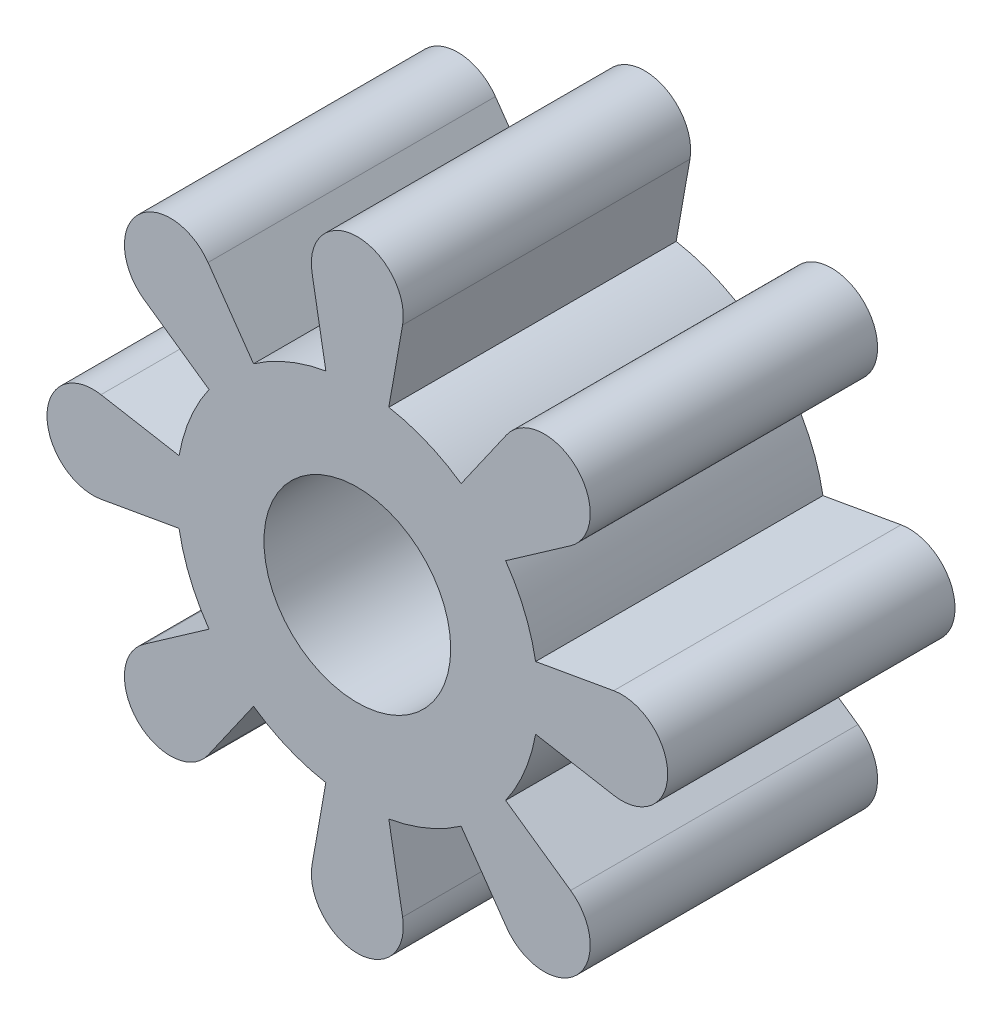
ISO-10303-21;
HEADER;
FILE_DESCRIPTION(('STEP AP214'),'2;1');
FILE_NAME('part.step','',(''),(''),'','','');
FILE_SCHEMA(('AUTOMOTIVE_DESIGN { 1 0 10303 214 1 1 1 1 }'));
ENDSEC;
DATA;
#1=APPLICATION_CONTEXT('core data for automotive mechanical design processes');
#2=APPLICATION_PROTOCOL_DEFINITION('international standard','automotive_design',2000,#1);
#3=PRODUCT_CONTEXT('',#1,'mechanical');
#4=PRODUCT('Part','Part','',(#3));
#5=PRODUCT_RELATED_PRODUCT_CATEGORY('part','',(#4));
#6=PRODUCT_DEFINITION_FORMATION('','',#4);
#7=PRODUCT_DEFINITION_CONTEXT('part definition',#1,'design');
#8=PRODUCT_DEFINITION('design','',#6,#7);
#9=PRODUCT_DEFINITION_SHAPE('','',#8);
#10=(LENGTH_UNIT() NAMED_UNIT(*) SI_UNIT(.MILLI.,.METRE.));
#11=(NAMED_UNIT(*) PLANE_ANGLE_UNIT() SI_UNIT($,.RADIAN.));
#12=(NAMED_UNIT(*) SI_UNIT($,.STERADIAN.) SOLID_ANGLE_UNIT());
#13=UNCERTAINTY_MEASURE_WITH_UNIT(LENGTH_MEASURE(1.E-05),#10,'distance_accuracy_value','');
#14=(GEOMETRIC_REPRESENTATION_CONTEXT(3) GLOBAL_UNCERTAINTY_ASSIGNED_CONTEXT((#13)) GLOBAL_UNIT_ASSIGNED_CONTEXT((#10,
#11,#12)) REPRESENTATION_CONTEXT('',''));
#15=CARTESIAN_POINT('',(0.,0.,0.));
#16=DIRECTION('',(0.,0.,1.));
#17=DIRECTION('',(1.,0.,0.));
#18=AXIS2_PLACEMENT_3D('',#15,#16,#17);
#19=CARTESIAN_POINT('',(0.,0.,10.));
#20=DIRECTION('',(0.,0.,1.));
#21=DIRECTION('',(1.,0.,0.));
#22=AXIS2_PLACEMENT_3D('',#19,#20,#21);
#23=PLANE('',#22);
#24=CARTESIAN_POINT('',(0.,0.,10.));
#25=DIRECTION('',(0.,0.,1.));
#26=DIRECTION('',(1.,0.,0.));
#27=AXIS2_PLACEMENT_3D('',#24,#25,#26);
#28=CIRCLE('',#27,6.3);
#29=CARTESIAN_POINT('',(3.61214341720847,5.16162958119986,10.));
#30=VERTEX_POINT('',#29);
#31=CARTESIAN_POINT('',(1.09565217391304,6.20399438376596,10.));
#32=VERTEX_POINT('',#31);
#33=EDGE_CURVE('E335',#30,#32,#28,.T.);
#34=ORIENTED_EDGE('',*,*,#33,.T.);
#35=DIRECTION('',(0.17391304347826,0.984761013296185,0.));
#36=VECTOR('',#35,1.);
#37=CARTESIAN_POINT('',(1.09565217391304,6.20399438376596,10.));
#38=LINE('',#37,#36);
#39=CARTESIAN_POINT('',(1.57561762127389,8.92173913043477,10.));
#40=VERTEX_POINT('',#39);
#41=EDGE_CURVE('E163',#32,#40,#38,.T.);
#42=ORIENTED_EDGE('',*,*,#41,.T.);
#43=CARTESIAN_POINT('',(0.,9.19999999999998,10.));
#44=DIRECTION('',(0.,0.,1.));
#45=DIRECTION('',(1.,0.,0.));
#46=AXIS2_PLACEMENT_3D('',#43,#44,#45);
#47=CIRCLE('',#46,1.59999999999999);
#48=CARTESIAN_POINT('',(-1.57561762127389,8.92173913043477,10.));
#49=VERTEX_POINT('',#48);
#50=EDGE_CURVE('E422',#40,#49,#47,.T.);
#51=ORIENTED_EDGE('',*,*,#50,.T.);
#52=DIRECTION('',(0.17391304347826,-0.984761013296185,0.));
#53=VECTOR('',#52,1.);
#54=CARTESIAN_POINT('',(-1.09565217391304,6.20399438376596,10.));
#55=LINE('',#54,#53);
#56=CARTESIAN_POINT('',(-1.09565217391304,6.20399438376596,10.));
#57=VERTEX_POINT('',#56);
#58=EDGE_CURVE('E441',#49,#57,#55,.T.);
#59=ORIENTED_EDGE('',*,*,#58,.T.);
#60=CARTESIAN_POINT('',(0.,0.,10.));
#61=DIRECTION('',(0.,0.,1.));
#62=DIRECTION('',(1.,0.,0.));
#63=AXIS2_PLACEMENT_3D('',#60,#61,#62);
#64=CIRCLE('',#63,6.3);
#65=CARTESIAN_POINT('',(-3.61214341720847,5.16162958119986,10.));
#66=VERTEX_POINT('',#65);
#67=EDGE_CURVE('E438',#57,#66,#64,.T.);
#68=ORIENTED_EDGE('',*,*,#67,.T.);
#69=DIRECTION('',(-0.573356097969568,0.819306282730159,0.));
#70=VECTOR('',#69,1.);
#71=CARTESIAN_POINT('',(-3.61214341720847,5.16162958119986,10.));
#72=LINE('',#71,#70);
#73=CARTESIAN_POINT('',(-5.19449233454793,7.42275214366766,10.));
#74=VERTEX_POINT('',#73);
#75=EDGE_CURVE('E440',#66,#74,#72,.T.);
#76=ORIENTED_EDGE('',*,*,#75,.T.);
#77=CARTESIAN_POINT('',(-6.50538238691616,6.50538238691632,10.));
#78=DIRECTION('',(0.,0.,1.));
#79=DIRECTION('',(1.,0.,0.));
#80=AXIS2_PLACEMENT_3D('',#77,#78,#79);
#81=CIRCLE('',#80,1.6);
#82=CARTESIAN_POINT('',(-7.42275214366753,5.19449233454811,10.));
#83=VERTEX_POINT('',#82);
#84=EDGE_CURVE('E443',#74,#83,#81,.T.);
#85=ORIENTED_EDGE('',*,*,#84,.T.);
#86=DIRECTION('',(0.819306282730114,-0.573356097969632,0.));
#87=VECTOR('',#86,1.);
#88=CARTESIAN_POINT('',(-5.16162958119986,3.61214341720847,10.));
#89=LINE('',#88,#87);
#90=CARTESIAN_POINT('',(-5.16162958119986,3.61214341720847,10.));
#91=VERTEX_POINT('',#90);
#92=EDGE_CURVE('E449',#83,#91,#89,.T.);
#93=ORIENTED_EDGE('',*,*,#92,.T.);
#94=CARTESIAN_POINT('',(0.,0.,10.));
#95=DIRECTION('',(0.,0.,1.));
#96=DIRECTION('',(1.,0.,0.));
#97=AXIS2_PLACEMENT_3D('',#94,#95,#96);
#98=CIRCLE('',#97,6.29999999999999);
#99=CARTESIAN_POINT('',(-6.20399438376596,1.09565217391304,10.));
#100=VERTEX_POINT('',#99);
#101=EDGE_CURVE('E451',#91,#100,#98,.T.);
#102=ORIENTED_EDGE('',*,*,#101,.T.);
#103=DIRECTION('',(-0.984761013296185,0.173913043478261,0.));
#104=VECTOR('',#103,1.);
#105=CARTESIAN_POINT('',(-6.20399438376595,1.09565217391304,10.));
#106=LINE('',#105,#104);
#107=CARTESIAN_POINT('',(-8.92173913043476,1.57561762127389,10.));
#108=VERTEX_POINT('',#107);
#109=EDGE_CURVE('E453',#100,#108,#106,.T.);
#110=ORIENTED_EDGE('',*,*,#109,.T.);
#111=CARTESIAN_POINT('',(-9.19999999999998,0.,10.));
#112=DIRECTION('',(0.,0.,1.));
#113=DIRECTION('',(1.,0.,0.));
#114=AXIS2_PLACEMENT_3D('',#111,#112,#113);
#115=CIRCLE('',#114,1.6);
#116=CARTESIAN_POINT('',(-8.92173913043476,-1.5756176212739,10.));
#117=VERTEX_POINT('',#116);
#118=EDGE_CURVE('E455',#108,#117,#115,.T.);
#119=ORIENTED_EDGE('',*,*,#118,.T.);
#120=DIRECTION('',(0.984761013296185,0.173913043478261,0.));
#121=VECTOR('',#120,1.);
#122=CARTESIAN_POINT('',(-6.20399438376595,-1.09565217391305,10.));
#123=LINE('',#122,#121);
#124=CARTESIAN_POINT('',(-6.20399438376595,-1.09565217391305,10.));
#125=VERTEX_POINT('',#124);
#126=EDGE_CURVE('E457',#117,#125,#123,.T.);
#127=ORIENTED_EDGE('',*,*,#126,.T.);
#128=CARTESIAN_POINT('',(0.,0.,10.));
#129=DIRECTION('',(0.,0.,1.));
#130=DIRECTION('',(1.,0.,0.));
#131=AXIS2_PLACEMENT_3D('',#128,#129,#130);
#132=CIRCLE('',#131,6.29999999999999);
#133=CARTESIAN_POINT('',(-5.16162958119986,-3.61214341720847,10.));
#134=VERTEX_POINT('',#133);
#135=EDGE_CURVE('E459',#125,#134,#132,.T.);
#136=ORIENTED_EDGE('',*,*,#135,.T.);
#137=DIRECTION('',(-0.819306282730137,-0.5733560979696,0.));
#138=VECTOR('',#137,1.);
#139=CARTESIAN_POINT('',(-5.16162958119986,-3.61214341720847,10.));
#140=LINE('',#139,#138);
#141=CARTESIAN_POINT('',(-7.42275214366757,-5.19449233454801,10.));
#142=VERTEX_POINT('',#141);
#143=EDGE_CURVE('E461',#134,#142,#140,.T.);
#144=ORIENTED_EDGE('',*,*,#143,.T.);
#145=CARTESIAN_POINT('',(-6.50538238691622,-6.50538238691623,10.));
#146=DIRECTION('',(0.,0.,1.));
#147=DIRECTION('',(1.,0.,0.));
#148=AXIS2_PLACEMENT_3D('',#145,#146,#147);
#149=CIRCLE('',#148,1.6);
#150=CARTESIAN_POINT('',(-5.194492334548,-7.42275214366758,10.));
#151=VERTEX_POINT('',#150);
#152=EDGE_CURVE('E463',#142,#151,#149,.T.);
#153=ORIENTED_EDGE('',*,*,#152,.T.);
#154=DIRECTION('',(0.573356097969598,0.819306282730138,0.));
#155=VECTOR('',#154,1.);
#156=CARTESIAN_POINT('',(-3.61214341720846,-5.16162958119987,10.));
#157=LINE('',#156,#155);
#158=CARTESIAN_POINT('',(-3.61214341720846,-5.16162958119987,10.));
#159=VERTEX_POINT('',#158);
#160=EDGE_CURVE('E465',#151,#159,#157,.T.);
#161=ORIENTED_EDGE('',*,*,#160,.T.);
#162=CARTESIAN_POINT('',(0.,0.,10.));
#163=DIRECTION('',(0.,0.,1.));
#164=DIRECTION('',(1.,0.,0.));
#165=AXIS2_PLACEMENT_3D('',#162,#163,#164);
#166=CIRCLE('',#165,6.29999999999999);
#167=CARTESIAN_POINT('',(-1.09565217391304,-6.20399438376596,10.));
#168=VERTEX_POINT('',#167);
#169=EDGE_CURVE('E467',#159,#168,#166,.T.);
#170=ORIENTED_EDGE('',*,*,#169,.T.);
#171=DIRECTION('',(-0.173913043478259,-0.984761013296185,0.));
#172=VECTOR('',#171,1.);
#173=CARTESIAN_POINT('',(-1.09565217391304,-6.20399438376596,10.));
#174=LINE('',#173,#172);
#175=CARTESIAN_POINT('',(-1.57561762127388,-8.92173913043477,10.));
#176=VERTEX_POINT('',#175);
#177=EDGE_CURVE('E469',#168,#176,#174,.T.);
#178=ORIENTED_EDGE('',*,*,#177,.T.);
#179=CARTESIAN_POINT('',(0.,-9.19999999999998,10.));
#180=DIRECTION('',(0.,0.,1.));
#181=DIRECTION('',(1.,0.,0.));
#182=AXIS2_PLACEMENT_3D('',#179,#180,#181);
#183=CIRCLE('',#182,1.6);
#184=CARTESIAN_POINT('',(1.5756176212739,-8.92173913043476,10.));
#185=VERTEX_POINT('',#184);
#186=EDGE_CURVE('E471',#176,#185,#183,.T.);
#187=ORIENTED_EDGE('',*,*,#186,.T.);
#188=DIRECTION('',(-0.173913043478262,0.984761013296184,0.));
#189=VECTOR('',#188,1.);
#190=CARTESIAN_POINT('',(1.09565217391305,-6.20399438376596,10.));
#191=LINE('',#190,#189);
#192=CARTESIAN_POINT('',(1.09565217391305,-6.20399438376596,10.));
#193=VERTEX_POINT('',#192);
#194=EDGE_CURVE('E473',#185,#193,#191,.T.);
#195=ORIENTED_EDGE('',*,*,#194,.T.);
#196=CARTESIAN_POINT('',(0.,0.,10.));
#197=DIRECTION('',(0.,0.,1.));
#198=DIRECTION('',(1.,0.,0.));
#199=AXIS2_PLACEMENT_3D('',#196,#197,#198);
#200=CIRCLE('',#199,6.29999999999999);
#201=CARTESIAN_POINT('',(3.61214341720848,-5.16162958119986,10.));
#202=VERTEX_POINT('',#201);
#203=EDGE_CURVE('E475',#193,#202,#200,.T.);
#204=ORIENTED_EDGE('',*,*,#203,.T.);
#205=DIRECTION('',(0.573356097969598,-0.819306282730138,0.));
#206=VECTOR('',#205,1.);
#207=CARTESIAN_POINT('',(3.61214341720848,-5.16162958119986,10.));
#208=LINE('',#207,#206);
#209=CARTESIAN_POINT('',(5.19449233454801,-7.42275214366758,10.));
#210=VERTEX_POINT('',#209);
#211=EDGE_CURVE('E477',#202,#210,#208,.T.);
#212=ORIENTED_EDGE('',*,*,#211,.T.);
#213=CARTESIAN_POINT('',(6.50538238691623,-6.50538238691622,10.));
#214=DIRECTION('',(0.,0.,1.));
#215=DIRECTION('',(1.,0.,0.));
#216=AXIS2_PLACEMENT_3D('',#213,#214,#215);
#217=CIRCLE('',#216,1.6);
#218=CARTESIAN_POINT('',(7.42275214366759,-5.194492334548,10.));
#219=VERTEX_POINT('',#218);
#220=EDGE_CURVE('E479',#210,#219,#217,.T.);
#221=ORIENTED_EDGE('',*,*,#220,.T.);
#222=DIRECTION('',(-0.819306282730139,0.573356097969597,0.));
#223=VECTOR('',#222,1.);
#224=CARTESIAN_POINT('',(5.16162958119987,-3.61214341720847,10.));
#225=LINE('',#224,#223);
#226=CARTESIAN_POINT('',(5.16162958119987,-3.61214341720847,10.));
#227=VERTEX_POINT('',#226);
#228=EDGE_CURVE('E481',#219,#227,#225,.T.);
#229=ORIENTED_EDGE('',*,*,#228,.T.);
#230=CARTESIAN_POINT('',(0.,0.,10.));
#231=DIRECTION('',(0.,0.,1.));
#232=DIRECTION('',(1.,0.,0.));
#233=AXIS2_PLACEMENT_3D('',#230,#231,#232);
#234=CIRCLE('',#233,6.3);
#235=CARTESIAN_POINT('',(6.20399438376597,-1.09565217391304,10.));
#236=VERTEX_POINT('',#235);
#237=EDGE_CURVE('E483',#227,#236,#234,.T.);
#238=ORIENTED_EDGE('',*,*,#237,.T.);
#239=DIRECTION('',(0.984761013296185,-0.17391304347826,0.));
#240=VECTOR('',#239,1.);
#241=CARTESIAN_POINT('',(6.20399438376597,-1.09565217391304,10.));
#242=LINE('',#241,#240);
#243=CARTESIAN_POINT('',(8.92173913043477,-1.57561762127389,10.));
#244=VERTEX_POINT('',#243);
#245=EDGE_CURVE('E485',#236,#244,#242,.T.);
#246=ORIENTED_EDGE('',*,*,#245,.T.);
#247=CARTESIAN_POINT('',(9.19999999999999,0.,10.));
#248=DIRECTION('',(0.,0.,1.));
#249=DIRECTION('',(1.,0.,0.));
#250=AXIS2_PLACEMENT_3D('',#247,#248,#249);
#251=CIRCLE('',#250,1.6);
#252=CARTESIAN_POINT('',(8.92173913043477,1.57561762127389,10.));
#253=VERTEX_POINT('',#252);
#254=EDGE_CURVE('E487',#244,#253,#251,.T.);
#255=ORIENTED_EDGE('',*,*,#254,.T.);
#256=DIRECTION('',(-0.984761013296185,-0.17391304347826,0.));
#257=VECTOR('',#256,1.);
#258=CARTESIAN_POINT('',(6.20399438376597,1.09565217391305,10.));
#259=LINE('',#258,#257);
#260=CARTESIAN_POINT('',(6.20399438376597,1.09565217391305,10.));
#261=VERTEX_POINT('',#260);
#262=EDGE_CURVE('E489',#253,#261,#259,.T.);
#263=ORIENTED_EDGE('',*,*,#262,.T.);
#264=CARTESIAN_POINT('',(0.,0.,10.));
#265=DIRECTION('',(0.,0.,1.));
#266=DIRECTION('',(1.,0.,0.));
#267=AXIS2_PLACEMENT_3D('',#264,#265,#266);
#268=CIRCLE('',#267,6.3);
#269=CARTESIAN_POINT('',(5.16162958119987,3.61214341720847,10.));
#270=VERTEX_POINT('',#269);
#271=EDGE_CURVE('E254',#261,#270,#268,.T.);
#272=ORIENTED_EDGE('',*,*,#271,.T.);
#273=DIRECTION('',(0.819306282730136,0.5733560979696,0.));
#274=VECTOR('',#273,1.);
#275=CARTESIAN_POINT('',(5.16162958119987,3.61214341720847,10.));
#276=LINE('',#275,#274);
#277=CARTESIAN_POINT('',(7.42275214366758,5.19449233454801,10.));
#278=VERTEX_POINT('',#277);
#279=EDGE_CURVE('E248',#270,#278,#276,.T.);
#280=ORIENTED_EDGE('',*,*,#279,.T.);
#281=CARTESIAN_POINT('',(6.50538238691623,6.50538238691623,10.));
#282=DIRECTION('',(0.,0.,1.));
#283=DIRECTION('',(1.,0.,0.));
#284=AXIS2_PLACEMENT_3D('',#281,#282,#283);
#285=CIRCLE('',#284,1.59999999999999);
#286=CARTESIAN_POINT('',(5.19449233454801,7.42275214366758,10.));
#287=VERTEX_POINT('',#286);
#288=EDGE_CURVE('E252',#278,#287,#285,.T.);
#289=ORIENTED_EDGE('',*,*,#288,.T.);
#290=DIRECTION('',(-0.5733560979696,-0.819306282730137,0.));
#291=VECTOR('',#290,1.);
#292=CARTESIAN_POINT('',(3.61214341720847,5.16162958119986,10.));
#293=LINE('',#292,#291);
#294=EDGE_CURVE('E48',#287,#30,#293,.T.);
#295=ORIENTED_EDGE('',*,*,#294,.T.);
#296=EDGE_LOOP('',(#34,#42,#51,#59,#68,#76,#85,#93,#102,#110,#119,#127,#136,#144,#153,#161,#170,
#178,#187,#195,#204,#212,#221,#229,#238,#246,#255,#263,#272,#280,#289,#295));
#297=FACE_BOUND('',#296,.T.);
#298=CARTESIAN_POINT('',(0.,0.,10.));
#299=DIRECTION('',(0.,0.,1.));
#300=DIRECTION('',(1.,0.,0.));
#301=AXIS2_PLACEMENT_3D('',#298,#299,#300);
#302=CIRCLE('',#301,3.25);
#303=CARTESIAN_POINT('',(3.25,0.,10.));
#304=VERTEX_POINT('',#303);
#305=EDGE_CURVE('E276',#304,#304,#302,.T.);
#306=ORIENTED_EDGE('',*,*,#305,.F.);
#307=EDGE_LOOP('',(#306));
#308=FACE_BOUND('',#307,.T.);
#309=ADVANCED_FACE('F31',(#297,#308),#23,.T.);
#310=CARTESIAN_POINT('',(0.,0.,0.));
#311=DIRECTION('',(0.,0.,1.));
#312=DIRECTION('',(1.,0.,0.));
#313=AXIS2_PLACEMENT_3D('',#310,#311,#312);
#314=PLANE('',#313);
#315=CARTESIAN_POINT('',(0.,0.,0.));
#316=DIRECTION('',(0.,0.,1.));
#317=DIRECTION('',(1.,0.,0.));
#318=AXIS2_PLACEMENT_3D('',#315,#316,#317);
#319=CIRCLE('',#318,6.3);
#320=CARTESIAN_POINT('',(3.61214341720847,5.16162958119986,0.));
#321=VERTEX_POINT('',#320);
#322=CARTESIAN_POINT('',(1.09565217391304,6.20399438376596,0.));
#323=VERTEX_POINT('',#322);
#324=EDGE_CURVE('E272',#321,#323,#319,.T.);
#325=ORIENTED_EDGE('',*,*,#324,.F.);
#326=DIRECTION('',(-0.5733560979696,-0.819306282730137,0.));
#327=VECTOR('',#326,1.);
#328=CARTESIAN_POINT('',(3.61214341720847,5.16162958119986,0.));
#329=LINE('',#328,#327);
#330=CARTESIAN_POINT('',(5.19449233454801,7.42275214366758,0.));
#331=VERTEX_POINT('',#330);
#332=EDGE_CURVE('E155',#331,#321,#329,.T.);
#333=ORIENTED_EDGE('',*,*,#332,.F.);
#334=CARTESIAN_POINT('',(6.50538238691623,6.50538238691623,0.));
#335=DIRECTION('',(0.,0.,1.));
#336=DIRECTION('',(1.,0.,0.));
#337=AXIS2_PLACEMENT_3D('',#334,#335,#336);
#338=CIRCLE('',#337,1.59999999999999);
#339=CARTESIAN_POINT('',(7.42275214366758,5.19449233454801,0.));
#340=VERTEX_POINT('',#339);
#341=EDGE_CURVE('E149',#340,#331,#338,.T.);
#342=ORIENTED_EDGE('',*,*,#341,.F.);
#343=DIRECTION('',(0.819306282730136,0.5733560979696,0.));
#344=VECTOR('',#343,1.);
#345=CARTESIAN_POINT('',(5.16162958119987,3.61214341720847,0.));
#346=LINE('',#345,#344);
#347=CARTESIAN_POINT('',(5.16162958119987,3.61214341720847,0.));
#348=VERTEX_POINT('',#347);
#349=EDGE_CURVE('E262',#348,#340,#346,.T.);
#350=ORIENTED_EDGE('',*,*,#349,.F.);
#351=CARTESIAN_POINT('',(0.,0.,0.));
#352=DIRECTION('',(0.,0.,1.));
#353=DIRECTION('',(1.,0.,0.));
#354=AXIS2_PLACEMENT_3D('',#351,#352,#353);
#355=CIRCLE('',#354,6.3);
#356=CARTESIAN_POINT('',(6.20399438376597,1.09565217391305,0.));
#357=VERTEX_POINT('',#356);
#358=EDGE_CURVE('E330',#357,#348,#355,.T.);
#359=ORIENTED_EDGE('',*,*,#358,.F.);
#360=DIRECTION('',(-0.984761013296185,-0.17391304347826,0.));
#361=VECTOR('',#360,1.);
#362=CARTESIAN_POINT('',(6.20399438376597,1.09565217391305,0.));
#363=LINE('',#362,#361);
#364=CARTESIAN_POINT('',(8.92173913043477,1.57561762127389,0.));
#365=VERTEX_POINT('',#364);
#366=EDGE_CURVE('E328',#365,#357,#363,.T.);
#367=ORIENTED_EDGE('',*,*,#366,.F.);
#368=CARTESIAN_POINT('',(9.19999999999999,0.,0.));
#369=DIRECTION('',(0.,0.,1.));
#370=DIRECTION('',(1.,0.,0.));
#371=AXIS2_PLACEMENT_3D('',#368,#369,#370);
#372=CIRCLE('',#371,1.6);
#373=CARTESIAN_POINT('',(8.92173913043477,-1.57561762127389,0.));
#374=VERTEX_POINT('',#373);
#375=EDGE_CURVE('E326',#374,#365,#372,.T.);
#376=ORIENTED_EDGE('',*,*,#375,.F.);
#377=DIRECTION('',(0.984761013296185,-0.17391304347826,0.));
#378=VECTOR('',#377,1.);
#379=CARTESIAN_POINT('',(6.20399438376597,-1.09565217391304,0.));
#380=LINE('',#379,#378);
#381=CARTESIAN_POINT('',(6.20399438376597,-1.09565217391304,0.));
#382=VERTEX_POINT('',#381);
#383=EDGE_CURVE('E324',#382,#374,#380,.T.);
#384=ORIENTED_EDGE('',*,*,#383,.F.);
#385=CARTESIAN_POINT('',(0.,0.,0.));
#386=DIRECTION('',(0.,0.,1.));
#387=DIRECTION('',(1.,0.,0.));
#388=AXIS2_PLACEMENT_3D('',#385,#386,#387);
#389=CIRCLE('',#388,6.3);
#390=CARTESIAN_POINT('',(5.16162958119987,-3.61214341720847,0.));
#391=VERTEX_POINT('',#390);
#392=EDGE_CURVE('E322',#391,#382,#389,.T.);
#393=ORIENTED_EDGE('',*,*,#392,.F.);
#394=DIRECTION('',(-0.819306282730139,0.573356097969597,0.));
#395=VECTOR('',#394,1.);
#396=CARTESIAN_POINT('',(5.16162958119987,-3.61214341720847,0.));
#397=LINE('',#396,#395);
#398=CARTESIAN_POINT('',(7.42275214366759,-5.194492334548,0.));
#399=VERTEX_POINT('',#398);
#400=EDGE_CURVE('E320',#399,#391,#397,.T.);
#401=ORIENTED_EDGE('',*,*,#400,.F.);
#402=CARTESIAN_POINT('',(6.50538238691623,-6.50538238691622,0.));
#403=DIRECTION('',(0.,0.,1.));
#404=DIRECTION('',(1.,0.,0.));
#405=AXIS2_PLACEMENT_3D('',#402,#403,#404);
#406=CIRCLE('',#405,1.6);
#407=CARTESIAN_POINT('',(5.19449233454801,-7.42275214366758,0.));
#408=VERTEX_POINT('',#407);
#409=EDGE_CURVE('E318',#408,#399,#406,.T.);
#410=ORIENTED_EDGE('',*,*,#409,.F.);
#411=DIRECTION('',(0.573356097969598,-0.819306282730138,0.));
#412=VECTOR('',#411,1.);
#413=CARTESIAN_POINT('',(3.61214341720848,-5.16162958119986,0.));
#414=LINE('',#413,#412);
#415=CARTESIAN_POINT('',(3.61214341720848,-5.16162958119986,0.));
#416=VERTEX_POINT('',#415);
#417=EDGE_CURVE('E316',#416,#408,#414,.T.);
#418=ORIENTED_EDGE('',*,*,#417,.F.);
#419=CARTESIAN_POINT('',(0.,0.,0.));
#420=DIRECTION('',(0.,0.,1.));
#421=DIRECTION('',(1.,0.,0.));
#422=AXIS2_PLACEMENT_3D('',#419,#420,#421);
#423=CIRCLE('',#422,6.29999999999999);
#424=CARTESIAN_POINT('',(1.09565217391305,-6.20399438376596,0.));
#425=VERTEX_POINT('',#424);
#426=EDGE_CURVE('E314',#425,#416,#423,.T.);
#427=ORIENTED_EDGE('',*,*,#426,.F.);
#428=DIRECTION('',(-0.173913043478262,0.984761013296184,0.));
#429=VECTOR('',#428,1.);
#430=CARTESIAN_POINT('',(1.09565217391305,-6.20399438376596,0.));
#431=LINE('',#430,#429);
#432=CARTESIAN_POINT('',(1.5756176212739,-8.92173913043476,0.));
#433=VERTEX_POINT('',#432);
#434=EDGE_CURVE('E312',#433,#425,#431,.T.);
#435=ORIENTED_EDGE('',*,*,#434,.F.);
#436=CARTESIAN_POINT('',(0.,-9.19999999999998,0.));
#437=DIRECTION('',(0.,0.,1.));
#438=DIRECTION('',(1.,0.,0.));
#439=AXIS2_PLACEMENT_3D('',#436,#437,#438);
#440=CIRCLE('',#439,1.6);
#441=CARTESIAN_POINT('',(-1.57561762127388,-8.92173913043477,0.));
#442=VERTEX_POINT('',#441);
#443=EDGE_CURVE('E310',#442,#433,#440,.T.);
#444=ORIENTED_EDGE('',*,*,#443,.F.);
#445=DIRECTION('',(-0.173913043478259,-0.984761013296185,0.));
#446=VECTOR('',#445,1.);
#447=CARTESIAN_POINT('',(-1.09565217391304,-6.20399438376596,0.));
#448=LINE('',#447,#446);
#449=CARTESIAN_POINT('',(-1.09565217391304,-6.20399438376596,0.));
#450=VERTEX_POINT('',#449);
#451=EDGE_CURVE('E308',#450,#442,#448,.T.);
#452=ORIENTED_EDGE('',*,*,#451,.F.);
#453=CARTESIAN_POINT('',(0.,0.,0.));
#454=DIRECTION('',(0.,0.,1.));
#455=DIRECTION('',(1.,0.,0.));
#456=AXIS2_PLACEMENT_3D('',#453,#454,#455);
#457=CIRCLE('',#456,6.29999999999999);
#458=CARTESIAN_POINT('',(-3.61214341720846,-5.16162958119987,0.));
#459=VERTEX_POINT('',#458);
#460=EDGE_CURVE('E306',#459,#450,#457,.T.);
#461=ORIENTED_EDGE('',*,*,#460,.F.);
#462=DIRECTION('',(0.573356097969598,0.819306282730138,0.));
#463=VECTOR('',#462,1.);
#464=CARTESIAN_POINT('',(-3.61214341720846,-5.16162958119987,0.));
#465=LINE('',#464,#463);
#466=CARTESIAN_POINT('',(-5.194492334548,-7.42275214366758,0.));
#467=VERTEX_POINT('',#466);
#468=EDGE_CURVE('E304',#467,#459,#465,.T.);
#469=ORIENTED_EDGE('',*,*,#468,.F.);
#470=CARTESIAN_POINT('',(-6.50538238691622,-6.50538238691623,0.));
#471=DIRECTION('',(0.,0.,1.));
#472=DIRECTION('',(1.,0.,0.));
#473=AXIS2_PLACEMENT_3D('',#470,#471,#472);
#474=CIRCLE('',#473,1.6);
#475=CARTESIAN_POINT('',(-7.42275214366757,-5.19449233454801,0.));
#476=VERTEX_POINT('',#475);
#477=EDGE_CURVE('E302',#476,#467,#474,.T.);
#478=ORIENTED_EDGE('',*,*,#477,.F.);
#479=DIRECTION('',(-0.819306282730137,-0.5733560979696,0.));
#480=VECTOR('',#479,1.);
#481=CARTESIAN_POINT('',(-5.16162958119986,-3.61214341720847,0.));
#482=LINE('',#481,#480);
#483=CARTESIAN_POINT('',(-5.16162958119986,-3.61214341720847,0.));
#484=VERTEX_POINT('',#483);
#485=EDGE_CURVE('E300',#484,#476,#482,.T.);
#486=ORIENTED_EDGE('',*,*,#485,.F.);
#487=CARTESIAN_POINT('',(0.,0.,0.));
#488=DIRECTION('',(0.,0.,1.));
#489=DIRECTION('',(1.,0.,0.));
#490=AXIS2_PLACEMENT_3D('',#487,#488,#489);
#491=CIRCLE('',#490,6.29999999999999);
#492=CARTESIAN_POINT('',(-6.20399438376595,-1.09565217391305,0.));
#493=VERTEX_POINT('',#492);
#494=EDGE_CURVE('E298',#493,#484,#491,.T.);
#495=ORIENTED_EDGE('',*,*,#494,.F.);
#496=DIRECTION('',(0.984761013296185,0.173913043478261,0.));
#497=VECTOR('',#496,1.);
#498=CARTESIAN_POINT('',(-6.20399438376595,-1.09565217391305,0.));
#499=LINE('',#498,#497);
#500=CARTESIAN_POINT('',(-8.92173913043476,-1.5756176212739,0.));
#501=VERTEX_POINT('',#500);
#502=EDGE_CURVE('E296',#501,#493,#499,.T.);
#503=ORIENTED_EDGE('',*,*,#502,.F.);
#504=CARTESIAN_POINT('',(-9.19999999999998,0.,0.));
#505=DIRECTION('',(0.,0.,1.));
#506=DIRECTION('',(1.,0.,0.));
#507=AXIS2_PLACEMENT_3D('',#504,#505,#506);
#508=CIRCLE('',#507,1.6);
#509=CARTESIAN_POINT('',(-8.92173913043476,1.57561762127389,0.));
#510=VERTEX_POINT('',#509);
#511=EDGE_CURVE('E294',#510,#501,#508,.T.);
#512=ORIENTED_EDGE('',*,*,#511,.F.);
#513=DIRECTION('',(-0.984761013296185,0.173913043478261,0.));
#514=VECTOR('',#513,1.);
#515=CARTESIAN_POINT('',(-6.20399438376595,1.09565217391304,0.));
#516=LINE('',#515,#514);
#517=CARTESIAN_POINT('',(-6.20399438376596,1.09565217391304,0.));
#518=VERTEX_POINT('',#517);
#519=EDGE_CURVE('E292',#518,#510,#516,.T.);
#520=ORIENTED_EDGE('',*,*,#519,.F.);
#521=CARTESIAN_POINT('',(0.,0.,0.));
#522=DIRECTION('',(0.,0.,1.));
#523=DIRECTION('',(1.,0.,0.));
#524=AXIS2_PLACEMENT_3D('',#521,#522,#523);
#525=CIRCLE('',#524,6.29999999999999);
#526=CARTESIAN_POINT('',(-5.16162958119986,3.61214341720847,0.));
#527=VERTEX_POINT('',#526);
#528=EDGE_CURVE('E290',#527,#518,#525,.T.);
#529=ORIENTED_EDGE('',*,*,#528,.F.);
#530=DIRECTION('',(0.819306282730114,-0.573356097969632,0.));
#531=VECTOR('',#530,1.);
#532=CARTESIAN_POINT('',(-5.16162958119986,3.61214341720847,0.));
#533=LINE('',#532,#531);
#534=CARTESIAN_POINT('',(-7.42275214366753,5.19449233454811,0.));
#535=VERTEX_POINT('',#534);
#536=EDGE_CURVE('E288',#535,#527,#533,.T.);
#537=ORIENTED_EDGE('',*,*,#536,.F.);
#538=CARTESIAN_POINT('',(-6.50538238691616,6.50538238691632,0.));
#539=DIRECTION('',(0.,0.,1.));
#540=DIRECTION('',(1.,0.,0.));
#541=AXIS2_PLACEMENT_3D('',#538,#539,#540);
#542=CIRCLE('',#541,1.6);
#543=CARTESIAN_POINT('',(-5.19449233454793,7.42275214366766,0.));
#544=VERTEX_POINT('',#543);
#545=EDGE_CURVE('E286',#544,#535,#542,.T.);
#546=ORIENTED_EDGE('',*,*,#545,.F.);
#547=DIRECTION('',(-0.573356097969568,0.819306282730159,0.));
#548=VECTOR('',#547,1.);
#549=CARTESIAN_POINT('',(-3.61214341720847,5.16162958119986,0.));
#550=LINE('',#549,#548);
#551=CARTESIAN_POINT('',(-3.61214341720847,5.16162958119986,0.));
#552=VERTEX_POINT('',#551);
#553=EDGE_CURVE('E284',#552,#544,#550,.T.);
#554=ORIENTED_EDGE('',*,*,#553,.F.);
#555=CARTESIAN_POINT('',(0.,0.,0.));
#556=DIRECTION('',(0.,0.,1.));
#557=DIRECTION('',(1.,0.,0.));
#558=AXIS2_PLACEMENT_3D('',#555,#556,#557);
#559=CIRCLE('',#558,6.3);
#560=CARTESIAN_POINT('',(-1.09565217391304,6.20399438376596,0.));
#561=VERTEX_POINT('',#560);
#562=EDGE_CURVE('E282',#561,#552,#559,.T.);
#563=ORIENTED_EDGE('',*,*,#562,.F.);
#564=DIRECTION('',(0.17391304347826,-0.984761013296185,0.));
#565=VECTOR('',#564,1.);
#566=CARTESIAN_POINT('',(-1.09565217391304,6.20399438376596,0.));
#567=LINE('',#566,#565);
#568=CARTESIAN_POINT('',(-1.57561762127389,8.92173913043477,0.));
#569=VERTEX_POINT('',#568);
#570=EDGE_CURVE('E280',#569,#561,#567,.T.);
#571=ORIENTED_EDGE('',*,*,#570,.F.);
#572=CARTESIAN_POINT('',(0.,9.19999999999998,0.));
#573=DIRECTION('',(0.,0.,1.));
#574=DIRECTION('',(1.,0.,0.));
#575=AXIS2_PLACEMENT_3D('',#572,#573,#574);
#576=CIRCLE('',#575,1.59999999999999);
#577=CARTESIAN_POINT('',(1.57561762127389,8.92173913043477,0.));
#578=VERTEX_POINT('',#577);
#579=EDGE_CURVE('E278',#578,#569,#576,.T.);
#580=ORIENTED_EDGE('',*,*,#579,.F.);
#581=DIRECTION('',(0.17391304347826,0.984761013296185,0.));
#582=VECTOR('',#581,1.);
#583=CARTESIAN_POINT('',(1.09565217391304,6.20399438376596,0.));
#584=LINE('',#583,#582);
#585=EDGE_CURVE('E275',#323,#578,#584,.T.);
#586=ORIENTED_EDGE('',*,*,#585,.F.);
#587=EDGE_LOOP('',(#325,#333,#342,#350,#359,#367,#376,#384,#393,#401,#410,#418,#427,#435,#444,
#452,#461,#469,#478,#486,#495,#503,#512,#520,#529,#537,#546,#554,#563,#571,#580,#586));
#588=FACE_BOUND('',#587,.T.);
#589=CARTESIAN_POINT('',(0.,0.,0.));
#590=DIRECTION('',(0.,0.,1.));
#591=DIRECTION('',(1.,0.,0.));
#592=AXIS2_PLACEMENT_3D('',#589,#590,#591);
#593=CIRCLE('',#592,3.25);
#594=CARTESIAN_POINT('',(3.25,0.,0.));
#595=VERTEX_POINT('',#594);
#596=EDGE_CURVE('E896',#595,#595,#593,.T.);
#597=ORIENTED_EDGE('',*,*,#596,.T.);
#598=EDGE_LOOP('',(#597));
#599=FACE_BOUND('',#598,.T.);
#600=ADVANCED_FACE('F426',(#588,#599),#314,.F.);
#601=CARTESIAN_POINT('',(0.,0.,10.));
#602=DIRECTION('',(0.,0.,-1.));
#603=DIRECTION('',(-1.,0.,0.));
#604=AXIS2_PLACEMENT_3D('',#601,#602,#603);
#605=CYLINDRICAL_SURFACE('',#604,6.3);
#606=ORIENTED_EDGE('',*,*,#324,.T.);
#607=DIRECTION('',(0.,0.,-1.));
#608=VECTOR('',#607,1.);
#609=CARTESIAN_POINT('',(1.09565217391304,6.20399438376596,10.));
#610=LINE('',#609,#608);
#611=EDGE_CURVE('E11',#32,#323,#610,.T.);
#612=ORIENTED_EDGE('',*,*,#611,.F.);
#613=ORIENTED_EDGE('',*,*,#33,.F.);
#614=DIRECTION('',(0.,0.,-1.));
#615=VECTOR('',#614,1.);
#616=CARTESIAN_POINT('',(3.61214341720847,5.16162958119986,10.));
#617=LINE('',#616,#615);
#618=EDGE_CURVE('E268',#30,#321,#617,.T.);
#619=ORIENTED_EDGE('',*,*,#618,.T.);
#620=EDGE_LOOP('',(#606,#612,#613,#619));
#621=FACE_BOUND('',#620,.T.);
#622=ADVANCED_FACE('F33',(#621),#605,.T.);
#623=CARTESIAN_POINT('',(1.09565217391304,6.20399438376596,10.));
#624=DIRECTION('',(-0.984761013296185,0.17391304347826,0.));
#625=DIRECTION('',(-0.17391304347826,-0.984761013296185,0.));
#626=AXIS2_PLACEMENT_3D('',#623,#624,#625);
#627=PLANE('',#626);
#628=ORIENTED_EDGE('',*,*,#585,.T.);
#629=DIRECTION('',(0.,0.,-1.));
#630=VECTOR('',#629,1.);
#631=CARTESIAN_POINT('',(1.57561762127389,8.92173913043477,10.));
#632=LINE('',#631,#630);
#633=EDGE_CURVE('E40',#40,#578,#632,.T.);
#634=ORIENTED_EDGE('',*,*,#633,.F.);
#635=ORIENTED_EDGE('',*,*,#41,.F.);
#636=ORIENTED_EDGE('',*,*,#611,.T.);
#637=EDGE_LOOP('',(#628,#634,#635,#636));
#638=FACE_BOUND('',#637,.T.);
#639=ADVANCED_FACE('F523',(#638),#627,.F.);
#640=CARTESIAN_POINT('',(0.,9.19999999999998,10.));
#641=DIRECTION('',(0.,0.,-1.));
#642=DIRECTION('',(-1.,0.,0.));
#643=AXIS2_PLACEMENT_3D('',#640,#641,#642);
#644=CYLINDRICAL_SURFACE('',#643,1.59999999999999);
#645=ORIENTED_EDGE('',*,*,#579,.T.);
#646=DIRECTION('',(0.,0.,-1.));
#647=VECTOR('',#646,1.);
#648=CARTESIAN_POINT('',(-1.57561762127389,8.92173913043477,10.));
#649=LINE('',#648,#647);
#650=EDGE_CURVE('E414',#49,#569,#649,.T.);
#651=ORIENTED_EDGE('',*,*,#650,.F.);
#652=ORIENTED_EDGE('',*,*,#50,.F.);
#653=ORIENTED_EDGE('',*,*,#633,.T.);
#654=EDGE_LOOP('',(#645,#651,#652,#653));
#655=FACE_BOUND('',#654,.T.);
#656=ADVANCED_FACE('F420',(#655),#644,.T.);
#657=CARTESIAN_POINT('',(-1.09565217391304,6.20399438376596,10.));
#658=DIRECTION('',(0.984761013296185,0.17391304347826,0.));
#659=DIRECTION('',(-0.17391304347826,0.984761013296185,0.));
#660=AXIS2_PLACEMENT_3D('',#657,#658,#659);
#661=PLANE('',#660);
#662=ORIENTED_EDGE('',*,*,#570,.T.);
#663=DIRECTION('',(0.,0.,-1.));
#664=VECTOR('',#663,1.);
#665=CARTESIAN_POINT('',(-1.09565217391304,6.20399438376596,10.));
#666=LINE('',#665,#664);
#667=EDGE_CURVE('E411',#57,#561,#666,.T.);
#668=ORIENTED_EDGE('',*,*,#667,.F.);
#669=ORIENTED_EDGE('',*,*,#58,.F.);
#670=ORIENTED_EDGE('',*,*,#650,.T.);
#671=EDGE_LOOP('',(#662,#668,#669,#670));
#672=FACE_BOUND('',#671,.T.);
#673=ADVANCED_FACE('F432',(#672),#661,.F.);
#674=CARTESIAN_POINT('',(0.,0.,10.));
#675=DIRECTION('',(0.,0.,-1.));
#676=DIRECTION('',(-1.,0.,0.));
#677=AXIS2_PLACEMENT_3D('',#674,#675,#676);
#678=CYLINDRICAL_SURFACE('',#677,6.3);
#679=ORIENTED_EDGE('',*,*,#562,.T.);
#680=DIRECTION('',(0.,0.,-1.));
#681=VECTOR('',#680,1.);
#682=CARTESIAN_POINT('',(-3.61214341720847,5.16162958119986,10.));
#683=LINE('',#682,#681);
#684=EDGE_CURVE('E408',#66,#552,#683,.T.);
#685=ORIENTED_EDGE('',*,*,#684,.F.);
#686=ORIENTED_EDGE('',*,*,#67,.F.);
#687=ORIENTED_EDGE('',*,*,#667,.T.);
#688=EDGE_LOOP('',(#679,#685,#686,#687));
#689=FACE_BOUND('',#688,.T.);
#690=ADVANCED_FACE('F436',(#689),#678,.T.);
#691=CARTESIAN_POINT('',(-3.61214341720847,5.16162958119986,10.));
#692=DIRECTION('',(-0.819306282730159,-0.573356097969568,0.));
#693=DIRECTION('',(0.573356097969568,-0.819306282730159,0.));
#694=AXIS2_PLACEMENT_3D('',#691,#692,#693);
#695=PLANE('',#694);
#696=ORIENTED_EDGE('',*,*,#553,.T.);
#697=DIRECTION('',(0.,0.,-1.));
#698=VECTOR('',#697,1.);
#699=CARTESIAN_POINT('',(-5.19449233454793,7.42275214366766,10.));
#700=LINE('',#699,#698);
#701=EDGE_CURVE('E405',#74,#544,#700,.T.);
#702=ORIENTED_EDGE('',*,*,#701,.F.);
#703=ORIENTED_EDGE('',*,*,#75,.F.);
#704=ORIENTED_EDGE('',*,*,#684,.T.);
#705=EDGE_LOOP('',(#696,#702,#703,#704));
#706=FACE_BOUND('',#705,.T.);
#707=ADVANCED_FACE('F536',(#706),#695,.F.);
#708=CARTESIAN_POINT('',(-6.50538238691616,6.50538238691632,10.));
#709=DIRECTION('',(0.,0.,-1.));
#710=DIRECTION('',(-1.,0.,0.));
#711=AXIS2_PLACEMENT_3D('',#708,#709,#710);
#712=CYLINDRICAL_SURFACE('',#711,1.6);
#713=ORIENTED_EDGE('',*,*,#545,.T.);
#714=DIRECTION('',(0.,0.,-1.));
#715=VECTOR('',#714,1.);
#716=CARTESIAN_POINT('',(-7.42275214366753,5.19449233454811,10.));
#717=LINE('',#716,#715);
#718=EDGE_CURVE('E402',#83,#535,#717,.T.);
#719=ORIENTED_EDGE('',*,*,#718,.F.);
#720=ORIENTED_EDGE('',*,*,#84,.F.);
#721=ORIENTED_EDGE('',*,*,#701,.T.);
#722=EDGE_LOOP('',(#713,#719,#720,#721));
#723=FACE_BOUND('',#722,.T.);
#724=ADVANCED_FACE('F539',(#723),#712,.T.);
#725=CARTESIAN_POINT('',(-5.16162958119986,3.61214341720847,10.));
#726=DIRECTION('',(0.573356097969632,0.819306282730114,0.));
#727=DIRECTION('',(-0.819306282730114,0.573356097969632,0.));
#728=AXIS2_PLACEMENT_3D('',#725,#726,#727);
#729=PLANE('',#728);
#730=ORIENTED_EDGE('',*,*,#536,.T.);
#731=DIRECTION('',(0.,0.,-1.));
#732=VECTOR('',#731,1.);
#733=CARTESIAN_POINT('',(-5.16162958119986,3.61214341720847,10.));
#734=LINE('',#733,#732);
#735=EDGE_CURVE('E399',#91,#527,#734,.T.);
#736=ORIENTED_EDGE('',*,*,#735,.F.);
#737=ORIENTED_EDGE('',*,*,#92,.F.);
#738=ORIENTED_EDGE('',*,*,#718,.T.);
#739=EDGE_LOOP('',(#730,#736,#737,#738));
#740=FACE_BOUND('',#739,.T.);
#741=ADVANCED_FACE('F543',(#740),#729,.F.);
#742=CARTESIAN_POINT('',(0.,0.,10.));
#743=DIRECTION('',(0.,0.,-1.));
#744=DIRECTION('',(-1.,0.,0.));
#745=AXIS2_PLACEMENT_3D('',#742,#743,#744);
#746=CYLINDRICAL_SURFACE('',#745,6.29999999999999);
#747=ORIENTED_EDGE('',*,*,#528,.T.);
#748=DIRECTION('',(0.,0.,-1.));
#749=VECTOR('',#748,1.);
#750=CARTESIAN_POINT('',(-6.20399438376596,1.09565217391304,10.));
#751=LINE('',#750,#749);
#752=EDGE_CURVE('E396',#100,#518,#751,.T.);
#753=ORIENTED_EDGE('',*,*,#752,.F.);
#754=ORIENTED_EDGE('',*,*,#101,.F.);
#755=ORIENTED_EDGE('',*,*,#735,.T.);
#756=EDGE_LOOP('',(#747,#753,#754,#755));
#757=FACE_BOUND('',#756,.T.);
#758=ADVANCED_FACE('F547',(#757),#746,.T.);
#759=CARTESIAN_POINT('',(-6.20399438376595,1.09565217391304,10.));
#760=DIRECTION('',(-0.173913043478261,-0.984761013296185,0.));
#761=DIRECTION('',(0.984761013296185,-0.173913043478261,0.));
#762=AXIS2_PLACEMENT_3D('',#759,#760,#761);
#763=PLANE('',#762);
#764=ORIENTED_EDGE('',*,*,#519,.T.);
#765=DIRECTION('',(0.,0.,-1.));
#766=VECTOR('',#765,1.);
#767=CARTESIAN_POINT('',(-8.92173913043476,1.57561762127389,10.));
#768=LINE('',#767,#766);
#769=EDGE_CURVE('E393',#108,#510,#768,.T.);
#770=ORIENTED_EDGE('',*,*,#769,.F.);
#771=ORIENTED_EDGE('',*,*,#109,.F.);
#772=ORIENTED_EDGE('',*,*,#752,.T.);
#773=EDGE_LOOP('',(#764,#770,#771,#772));
#774=FACE_BOUND('',#773,.T.);
#775=ADVANCED_FACE('F551',(#774),#763,.F.);
#776=CARTESIAN_POINT('',(-9.19999999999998,0.,10.));
#777=DIRECTION('',(0.,0.,-1.));
#778=DIRECTION('',(-1.,0.,0.));
#779=AXIS2_PLACEMENT_3D('',#776,#777,#778);
#780=CYLINDRICAL_SURFACE('',#779,1.6);
#781=ORIENTED_EDGE('',*,*,#511,.T.);
#782=DIRECTION('',(0.,0.,-1.));
#783=VECTOR('',#782,1.);
#784=CARTESIAN_POINT('',(-8.92173913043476,-1.5756176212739,10.));
#785=LINE('',#784,#783);
#786=EDGE_CURVE('E390',#117,#501,#785,.T.);
#787=ORIENTED_EDGE('',*,*,#786,.F.);
#788=ORIENTED_EDGE('',*,*,#118,.F.);
#789=ORIENTED_EDGE('',*,*,#769,.T.);
#790=EDGE_LOOP('',(#781,#787,#788,#789));
#791=FACE_BOUND('',#790,.T.);
#792=ADVANCED_FACE('F555',(#791),#780,.T.);
#793=CARTESIAN_POINT('',(-6.20399438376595,-1.09565217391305,10.));
#794=DIRECTION('',(-0.173913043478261,0.984761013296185,0.));
#795=DIRECTION('',(-0.984761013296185,-0.173913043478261,0.));
#796=AXIS2_PLACEMENT_3D('',#793,#794,#795);
#797=PLANE('',#796);
#798=ORIENTED_EDGE('',*,*,#502,.T.);
#799=DIRECTION('',(0.,0.,-1.));
#800=VECTOR('',#799,1.);
#801=CARTESIAN_POINT('',(-6.20399438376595,-1.09565217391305,10.));
#802=LINE('',#801,#800);
#803=EDGE_CURVE('E387',#125,#493,#802,.T.);
#804=ORIENTED_EDGE('',*,*,#803,.F.);
#805=ORIENTED_EDGE('',*,*,#126,.F.);
#806=ORIENTED_EDGE('',*,*,#786,.T.);
#807=EDGE_LOOP('',(#798,#804,#805,#806));
#808=FACE_BOUND('',#807,.T.);
#809=ADVANCED_FACE('F559',(#808),#797,.F.);
#810=CARTESIAN_POINT('',(0.,0.,10.));
#811=DIRECTION('',(0.,0.,-1.));
#812=DIRECTION('',(-1.,0.,0.));
#813=AXIS2_PLACEMENT_3D('',#810,#811,#812);
#814=CYLINDRICAL_SURFACE('',#813,6.29999999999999);
#815=ORIENTED_EDGE('',*,*,#494,.T.);
#816=DIRECTION('',(0.,0.,-1.));
#817=VECTOR('',#816,1.);
#818=CARTESIAN_POINT('',(-5.16162958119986,-3.61214341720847,10.));
#819=LINE('',#818,#817);
#820=EDGE_CURVE('E384',#134,#484,#819,.T.);
#821=ORIENTED_EDGE('',*,*,#820,.F.);
#822=ORIENTED_EDGE('',*,*,#135,.F.);
#823=ORIENTED_EDGE('',*,*,#803,.T.);
#824=EDGE_LOOP('',(#815,#821,#822,#823));
#825=FACE_BOUND('',#824,.T.);
#826=ADVANCED_FACE('F563',(#825),#814,.T.);
#827=CARTESIAN_POINT('',(-5.16162958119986,-3.61214341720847,10.));
#828=DIRECTION('',(0.5733560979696,-0.819306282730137,0.));
#829=DIRECTION('',(0.819306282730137,0.5733560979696,0.));
#830=AXIS2_PLACEMENT_3D('',#827,#828,#829);
#831=PLANE('',#830);
#832=ORIENTED_EDGE('',*,*,#485,.T.);
#833=DIRECTION('',(0.,0.,-1.));
#834=VECTOR('',#833,1.);
#835=CARTESIAN_POINT('',(-7.42275214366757,-5.19449233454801,10.));
#836=LINE('',#835,#834);
#837=EDGE_CURVE('E381',#142,#476,#836,.T.);
#838=ORIENTED_EDGE('',*,*,#837,.F.);
#839=ORIENTED_EDGE('',*,*,#143,.F.);
#840=ORIENTED_EDGE('',*,*,#820,.T.);
#841=EDGE_LOOP('',(#832,#838,#839,#840));
#842=FACE_BOUND('',#841,.T.);
#843=ADVANCED_FACE('F567',(#842),#831,.F.);
#844=CARTESIAN_POINT('',(-6.50538238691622,-6.50538238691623,10.));
#845=DIRECTION('',(0.,0.,-1.));
#846=DIRECTION('',(-1.,0.,0.));
#847=AXIS2_PLACEMENT_3D('',#844,#845,#846);
#848=CYLINDRICAL_SURFACE('',#847,1.6);
#849=ORIENTED_EDGE('',*,*,#477,.T.);
#850=DIRECTION('',(0.,0.,-1.));
#851=VECTOR('',#850,1.);
#852=CARTESIAN_POINT('',(-5.194492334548,-7.42275214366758,10.));
#853=LINE('',#852,#851);
#854=EDGE_CURVE('E378',#151,#467,#853,.T.);
#855=ORIENTED_EDGE('',*,*,#854,.F.);
#856=ORIENTED_EDGE('',*,*,#152,.F.);
#857=ORIENTED_EDGE('',*,*,#837,.T.);
#858=EDGE_LOOP('',(#849,#855,#856,#857));
#859=FACE_BOUND('',#858,.T.);
#860=ADVANCED_FACE('F571',(#859),#848,.T.);
#861=CARTESIAN_POINT('',(-3.61214341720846,-5.16162958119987,10.));
#862=DIRECTION('',(-0.819306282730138,0.573356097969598,0.));
#863=DIRECTION('',(-0.573356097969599,-0.819306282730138,0.));
#864=AXIS2_PLACEMENT_3D('',#861,#862,#863);
#865=PLANE('',#864);
#866=ORIENTED_EDGE('',*,*,#468,.T.);
#867=DIRECTION('',(0.,0.,-1.));
#868=VECTOR('',#867,1.);
#869=CARTESIAN_POINT('',(-3.61214341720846,-5.16162958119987,10.));
#870=LINE('',#869,#868);
#871=EDGE_CURVE('E375',#159,#459,#870,.T.);
#872=ORIENTED_EDGE('',*,*,#871,.F.);
#873=ORIENTED_EDGE('',*,*,#160,.F.);
#874=ORIENTED_EDGE('',*,*,#854,.T.);
#875=EDGE_LOOP('',(#866,#872,#873,#874));
#876=FACE_BOUND('',#875,.T.);
#877=ADVANCED_FACE('F575',(#876),#865,.F.);
#878=CARTESIAN_POINT('',(0.,0.,10.));
#879=DIRECTION('',(0.,0.,-1.));
#880=DIRECTION('',(-1.,0.,0.));
#881=AXIS2_PLACEMENT_3D('',#878,#879,#880);
#882=CYLINDRICAL_SURFACE('',#881,6.29999999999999);
#883=ORIENTED_EDGE('',*,*,#460,.T.);
#884=DIRECTION('',(0.,0.,-1.));
#885=VECTOR('',#884,1.);
#886=CARTESIAN_POINT('',(-1.09565217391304,-6.20399438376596,10.));
#887=LINE('',#886,#885);
#888=EDGE_CURVE('E372',#168,#450,#887,.T.);
#889=ORIENTED_EDGE('',*,*,#888,.F.);
#890=ORIENTED_EDGE('',*,*,#169,.F.);
#891=ORIENTED_EDGE('',*,*,#871,.T.);
#892=EDGE_LOOP('',(#883,#889,#890,#891));
#893=FACE_BOUND('',#892,.T.);
#894=ADVANCED_FACE('F579',(#893),#882,.T.);
#895=CARTESIAN_POINT('',(-1.09565217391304,-6.20399438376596,10.));
#896=DIRECTION('',(0.984761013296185,-0.173913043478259,0.));
#897=DIRECTION('',(0.173913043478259,0.984761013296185,0.));
#898=AXIS2_PLACEMENT_3D('',#895,#896,#897);
#899=PLANE('',#898);
#900=ORIENTED_EDGE('',*,*,#451,.T.);
#901=DIRECTION('',(0.,0.,-1.));
#902=VECTOR('',#901,1.);
#903=CARTESIAN_POINT('',(-1.57561762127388,-8.92173913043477,10.));
#904=LINE('',#903,#902);
#905=EDGE_CURVE('E369',#176,#442,#904,.T.);
#906=ORIENTED_EDGE('',*,*,#905,.F.);
#907=ORIENTED_EDGE('',*,*,#177,.F.);
#908=ORIENTED_EDGE('',*,*,#888,.T.);
#909=EDGE_LOOP('',(#900,#906,#907,#908));
#910=FACE_BOUND('',#909,.T.);
#911=ADVANCED_FACE('F583',(#910),#899,.F.);
#912=CARTESIAN_POINT('',(0.,-9.19999999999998,10.));
#913=DIRECTION('',(0.,0.,-1.));
#914=DIRECTION('',(-1.,0.,0.));
#915=AXIS2_PLACEMENT_3D('',#912,#913,#914);
#916=CYLINDRICAL_SURFACE('',#915,1.6);
#917=ORIENTED_EDGE('',*,*,#443,.T.);
#918=DIRECTION('',(0.,0.,-1.));
#919=VECTOR('',#918,1.);
#920=CARTESIAN_POINT('',(1.5756176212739,-8.92173913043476,10.));
#921=LINE('',#920,#919);
#922=EDGE_CURVE('E366',#185,#433,#921,.T.);
#923=ORIENTED_EDGE('',*,*,#922,.F.);
#924=ORIENTED_EDGE('',*,*,#186,.F.);
#925=ORIENTED_EDGE('',*,*,#905,.T.);
#926=EDGE_LOOP('',(#917,#923,#924,#925));
#927=FACE_BOUND('',#926,.T.);
#928=ADVANCED_FACE('F587',(#927),#916,.T.);
#929=CARTESIAN_POINT('',(1.09565217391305,-6.20399438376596,10.));
#930=DIRECTION('',(-0.984761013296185,-0.173913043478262,0.));
#931=DIRECTION('',(0.173913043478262,-0.984761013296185,0.));
#932=AXIS2_PLACEMENT_3D('',#929,#930,#931);
#933=PLANE('',#932);
#934=ORIENTED_EDGE('',*,*,#434,.T.);
#935=DIRECTION('',(0.,0.,-1.));
#936=VECTOR('',#935,1.);
#937=CARTESIAN_POINT('',(1.09565217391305,-6.20399438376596,10.));
#938=LINE('',#937,#936);
#939=EDGE_CURVE('E363',#193,#425,#938,.T.);
#940=ORIENTED_EDGE('',*,*,#939,.F.);
#941=ORIENTED_EDGE('',*,*,#194,.F.);
#942=ORIENTED_EDGE('',*,*,#922,.T.);
#943=EDGE_LOOP('',(#934,#940,#941,#942));
#944=FACE_BOUND('',#943,.T.);
#945=ADVANCED_FACE('F591',(#944),#933,.F.);
#946=CARTESIAN_POINT('',(0.,0.,10.));
#947=DIRECTION('',(0.,0.,-1.));
#948=DIRECTION('',(-1.,0.,0.));
#949=AXIS2_PLACEMENT_3D('',#946,#947,#948);
#950=CYLINDRICAL_SURFACE('',#949,6.29999999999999);
#951=ORIENTED_EDGE('',*,*,#426,.T.);
#952=DIRECTION('',(0.,0.,-1.));
#953=VECTOR('',#952,1.);
#954=CARTESIAN_POINT('',(3.61214341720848,-5.16162958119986,10.));
#955=LINE('',#954,#953);
#956=EDGE_CURVE('E360',#202,#416,#955,.T.);
#957=ORIENTED_EDGE('',*,*,#956,.F.);
#958=ORIENTED_EDGE('',*,*,#203,.F.);
#959=ORIENTED_EDGE('',*,*,#939,.T.);
#960=EDGE_LOOP('',(#951,#957,#958,#959));
#961=FACE_BOUND('',#960,.T.);
#962=ADVANCED_FACE('F595',(#961),#950,.T.);
#963=CARTESIAN_POINT('',(3.61214341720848,-5.16162958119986,10.));
#964=DIRECTION('',(0.819306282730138,0.573356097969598,0.));
#965=DIRECTION('',(-0.573356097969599,0.819306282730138,0.));
#966=AXIS2_PLACEMENT_3D('',#963,#964,#965);
#967=PLANE('',#966);
#968=ORIENTED_EDGE('',*,*,#417,.T.);
#969=DIRECTION('',(0.,0.,-1.));
#970=VECTOR('',#969,1.);
#971=CARTESIAN_POINT('',(5.19449233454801,-7.42275214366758,10.));
#972=LINE('',#971,#970);
#973=EDGE_CURVE('E357',#210,#408,#972,.T.);
#974=ORIENTED_EDGE('',*,*,#973,.F.);
#975=ORIENTED_EDGE('',*,*,#211,.F.);
#976=ORIENTED_EDGE('',*,*,#956,.T.);
#977=EDGE_LOOP('',(#968,#974,#975,#976));
#978=FACE_BOUND('',#977,.T.);
#979=ADVANCED_FACE('F599',(#978),#967,.F.);
#980=CARTESIAN_POINT('',(6.50538238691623,-6.50538238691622,10.));
#981=DIRECTION('',(0.,0.,-1.));
#982=DIRECTION('',(-1.,0.,0.));
#983=AXIS2_PLACEMENT_3D('',#980,#981,#982);
#984=CYLINDRICAL_SURFACE('',#983,1.6);
#985=ORIENTED_EDGE('',*,*,#409,.T.);
#986=DIRECTION('',(0.,0.,-1.));
#987=VECTOR('',#986,1.);
#988=CARTESIAN_POINT('',(7.42275214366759,-5.194492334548,10.));
#989=LINE('',#988,#987);
#990=EDGE_CURVE('E354',#219,#399,#989,.T.);
#991=ORIENTED_EDGE('',*,*,#990,.F.);
#992=ORIENTED_EDGE('',*,*,#220,.F.);
#993=ORIENTED_EDGE('',*,*,#973,.T.);
#994=EDGE_LOOP('',(#985,#991,#992,#993));
#995=FACE_BOUND('',#994,.T.);
#996=ADVANCED_FACE('F603',(#995),#984,.T.);
#997=CARTESIAN_POINT('',(5.16162958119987,-3.61214341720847,10.));
#998=DIRECTION('',(-0.573356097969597,-0.819306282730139,0.));
#999=DIRECTION('',(0.819306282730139,-0.573356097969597,0.));
#1000=AXIS2_PLACEMENT_3D('',#997,#998,#999);
#1001=PLANE('',#1000);
#1002=ORIENTED_EDGE('',*,*,#400,.T.);
#1003=DIRECTION('',(0.,0.,-1.));
#1004=VECTOR('',#1003,1.);
#1005=CARTESIAN_POINT('',(5.16162958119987,-3.61214341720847,10.));
#1006=LINE('',#1005,#1004);
#1007=EDGE_CURVE('E351',#227,#391,#1006,.T.);
#1008=ORIENTED_EDGE('',*,*,#1007,.F.);
#1009=ORIENTED_EDGE('',*,*,#228,.F.);
#1010=ORIENTED_EDGE('',*,*,#990,.T.);
#1011=EDGE_LOOP('',(#1002,#1008,#1009,#1010));
#1012=FACE_BOUND('',#1011,.T.);
#1013=ADVANCED_FACE('F607',(#1012),#1001,.F.);
#1014=CARTESIAN_POINT('',(0.,0.,10.));
#1015=DIRECTION('',(0.,0.,-1.));
#1016=DIRECTION('',(-1.,0.,0.));
#1017=AXIS2_PLACEMENT_3D('',#1014,#1015,#1016);
#1018=CYLINDRICAL_SURFACE('',#1017,6.3);
#1019=ORIENTED_EDGE('',*,*,#392,.T.);
#1020=DIRECTION('',(0.,0.,-1.));
#1021=VECTOR('',#1020,1.);
#1022=CARTESIAN_POINT('',(6.20399438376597,-1.09565217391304,10.));
#1023=LINE('',#1022,#1021);
#1024=EDGE_CURVE('E348',#236,#382,#1023,.T.);
#1025=ORIENTED_EDGE('',*,*,#1024,.F.);
#1026=ORIENTED_EDGE('',*,*,#237,.F.);
#1027=ORIENTED_EDGE('',*,*,#1007,.T.);
#1028=EDGE_LOOP('',(#1019,#1025,#1026,#1027));
#1029=FACE_BOUND('',#1028,.T.);
#1030=ADVANCED_FACE('F611',(#1029),#1018,.T.);
#1031=CARTESIAN_POINT('',(6.20399438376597,-1.09565217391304,10.));
#1032=DIRECTION('',(0.17391304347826,0.984761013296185,0.));
#1033=DIRECTION('',(-0.984761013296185,0.17391304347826,0.));
#1034=AXIS2_PLACEMENT_3D('',#1031,#1032,#1033);
#1035=PLANE('',#1034);
#1036=ORIENTED_EDGE('',*,*,#383,.T.);
#1037=DIRECTION('',(0.,0.,-1.));
#1038=VECTOR('',#1037,1.);
#1039=CARTESIAN_POINT('',(8.92173913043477,-1.57561762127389,10.));
#1040=LINE('',#1039,#1038);
#1041=EDGE_CURVE('E345',#244,#374,#1040,.T.);
#1042=ORIENTED_EDGE('',*,*,#1041,.F.);
#1043=ORIENTED_EDGE('',*,*,#245,.F.);
#1044=ORIENTED_EDGE('',*,*,#1024,.T.);
#1045=EDGE_LOOP('',(#1036,#1042,#1043,#1044));
#1046=FACE_BOUND('',#1045,.T.);
#1047=ADVANCED_FACE('F615',(#1046),#1035,.F.);
#1048=CARTESIAN_POINT('',(9.19999999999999,0.,10.));
#1049=DIRECTION('',(0.,0.,-1.));
#1050=DIRECTION('',(-1.,0.,0.));
#1051=AXIS2_PLACEMENT_3D('',#1048,#1049,#1050);
#1052=CYLINDRICAL_SURFACE('',#1051,1.6);
#1053=ORIENTED_EDGE('',*,*,#375,.T.);
#1054=DIRECTION('',(0.,0.,-1.));
#1055=VECTOR('',#1054,1.);
#1056=CARTESIAN_POINT('',(8.92173913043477,1.57561762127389,10.));
#1057=LINE('',#1056,#1055);
#1058=EDGE_CURVE('E342',#253,#365,#1057,.T.);
#1059=ORIENTED_EDGE('',*,*,#1058,.F.);
#1060=ORIENTED_EDGE('',*,*,#254,.F.);
#1061=ORIENTED_EDGE('',*,*,#1041,.T.);
#1062=EDGE_LOOP('',(#1053,#1059,#1060,#1061));
#1063=FACE_BOUND('',#1062,.T.);
#1064=ADVANCED_FACE('F619',(#1063),#1052,.T.);
#1065=CARTESIAN_POINT('',(6.20399438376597,1.09565217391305,10.));
#1066=DIRECTION('',(0.17391304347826,-0.984761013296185,0.));
#1067=DIRECTION('',(0.984761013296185,0.17391304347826,0.));
#1068=AXIS2_PLACEMENT_3D('',#1065,#1066,#1067);
#1069=PLANE('',#1068);
#1070=ORIENTED_EDGE('',*,*,#366,.T.);
#1071=DIRECTION('',(0.,0.,-1.));
#1072=VECTOR('',#1071,1.);
#1073=CARTESIAN_POINT('',(6.20399438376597,1.09565217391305,10.));
#1074=LINE('',#1073,#1072);
#1075=EDGE_CURVE('E339',#261,#357,#1074,.T.);
#1076=ORIENTED_EDGE('',*,*,#1075,.F.);
#1077=ORIENTED_EDGE('',*,*,#262,.F.);
#1078=ORIENTED_EDGE('',*,*,#1058,.T.);
#1079=EDGE_LOOP('',(#1070,#1076,#1077,#1078));
#1080=FACE_BOUND('',#1079,.T.);
#1081=ADVANCED_FACE('F495',(#1080),#1069,.F.);
#1082=CARTESIAN_POINT('',(0.,0.,10.));
#1083=DIRECTION('',(0.,0.,-1.));
#1084=DIRECTION('',(-1.,0.,0.));
#1085=AXIS2_PLACEMENT_3D('',#1082,#1083,#1084);
#1086=CYLINDRICAL_SURFACE('',#1085,6.3);
#1087=ORIENTED_EDGE('',*,*,#358,.T.);
#1088=DIRECTION('',(0.,0.,-1.));
#1089=VECTOR('',#1088,1.);
#1090=CARTESIAN_POINT('',(5.16162958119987,3.61214341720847,10.));
#1091=LINE('',#1090,#1089);
#1092=EDGE_CURVE('E263',#270,#348,#1091,.T.);
#1093=ORIENTED_EDGE('',*,*,#1092,.F.);
#1094=ORIENTED_EDGE('',*,*,#271,.F.);
#1095=ORIENTED_EDGE('',*,*,#1075,.T.);
#1096=EDGE_LOOP('',(#1087,#1093,#1094,#1095));
#1097=FACE_BOUND('',#1096,.T.);
#1098=ADVANCED_FACE('F499',(#1097),#1086,.T.);
#1099=CARTESIAN_POINT('',(5.16162958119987,3.61214341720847,10.));
#1100=DIRECTION('',(-0.5733560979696,0.819306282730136,0.));
#1101=DIRECTION('',(-0.819306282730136,-0.5733560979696,0.));
#1102=AXIS2_PLACEMENT_3D('',#1099,#1100,#1101);
#1103=PLANE('',#1102);
#1104=ORIENTED_EDGE('',*,*,#349,.T.);
#1105=DIRECTION('',(0.,0.,-1.));
#1106=VECTOR('',#1105,1.);
#1107=CARTESIAN_POINT('',(7.42275214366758,5.19449233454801,10.));
#1108=LINE('',#1107,#1106);
#1109=EDGE_CURVE('E259',#278,#340,#1108,.T.);
#1110=ORIENTED_EDGE('',*,*,#1109,.F.);
#1111=ORIENTED_EDGE('',*,*,#279,.F.);
#1112=ORIENTED_EDGE('',*,*,#1092,.T.);
#1113=EDGE_LOOP('',(#1104,#1110,#1111,#1112));
#1114=FACE_BOUND('',#1113,.T.);
#1115=ADVANCED_FACE('F260',(#1114),#1103,.F.);
#1116=CARTESIAN_POINT('',(6.50538238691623,6.50538238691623,10.));
#1117=DIRECTION('',(0.,0.,-1.));
#1118=DIRECTION('',(-1.,0.,0.));
#1119=AXIS2_PLACEMENT_3D('',#1116,#1117,#1118);
#1120=CYLINDRICAL_SURFACE('',#1119,1.59999999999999);
#1121=ORIENTED_EDGE('',*,*,#341,.T.);
#1122=DIRECTION('',(0.,0.,-1.));
#1123=VECTOR('',#1122,1.);
#1124=CARTESIAN_POINT('',(5.19449233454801,7.42275214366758,10.));
#1125=LINE('',#1124,#1123);
#1126=EDGE_CURVE('E264',#287,#331,#1125,.T.);
#1127=ORIENTED_EDGE('',*,*,#1126,.F.);
#1128=ORIENTED_EDGE('',*,*,#288,.F.);
#1129=ORIENTED_EDGE('',*,*,#1109,.T.);
#1130=EDGE_LOOP('',(#1121,#1127,#1128,#1129));
#1131=FACE_BOUND('',#1130,.T.);
#1132=ADVANCED_FACE('F266',(#1131),#1120,.T.);
#1133=CARTESIAN_POINT('',(3.61214341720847,5.16162958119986,10.));
#1134=DIRECTION('',(0.819306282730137,-0.5733560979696,0.));
#1135=DIRECTION('',(0.5733560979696,0.819306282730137,0.));
#1136=AXIS2_PLACEMENT_3D('',#1133,#1134,#1135);
#1137=PLANE('',#1136);
#1138=ORIENTED_EDGE('',*,*,#332,.T.);
#1139=ORIENTED_EDGE('',*,*,#618,.F.);
#1140=ORIENTED_EDGE('',*,*,#294,.F.);
#1141=ORIENTED_EDGE('',*,*,#1126,.T.);
#1142=EDGE_LOOP('',(#1138,#1139,#1140,#1141));
#1143=FACE_BOUND('',#1142,.T.);
#1144=ADVANCED_FACE('F503',(#1143),#1137,.F.);
#1145=CARTESIAN_POINT('',(0.,0.,10.));
#1146=DIRECTION('',(0.,0.,-1.));
#1147=DIRECTION('',(-1.,0.,0.));
#1148=AXIS2_PLACEMENT_3D('',#1145,#1146,#1147);
#1149=CYLINDRICAL_SURFACE('',#1148,3.25);
#1150=ORIENTED_EDGE('',*,*,#305,.T.);
#1151=EDGE_LOOP('',(#1150));
#1152=FACE_BOUND('',#1151,.T.);
#1153=ORIENTED_EDGE('',*,*,#596,.F.);
#1154=EDGE_LOOP('',(#1153));
#1155=FACE_BOUND('',#1154,.T.);
#1156=ADVANCED_FACE('F505',(#1152,#1155),#1149,.F.);
#1157=CLOSED_SHELL('',(#309,#600,#622,#639,#656,#673,#690,#707,#724,#741,#758,#775,#792,#809,
#826,#843,#860,#877,#894,#911,#928,#945,#962,#979,#996,#1013,#1030,#1047,#1064,#1081,#1098,
#1115,#1132,#1144,#1156));
#1158=MANIFOLD_SOLID_BREP('B2',#1157);
#1159=ADVANCED_BREP_SHAPE_REPRESENTATION('',(#18,#1158),#14);
#1160=SHAPE_DEFINITION_REPRESENTATION(#9,#1159);
ENDSEC;
END-ISO-10303-21;
